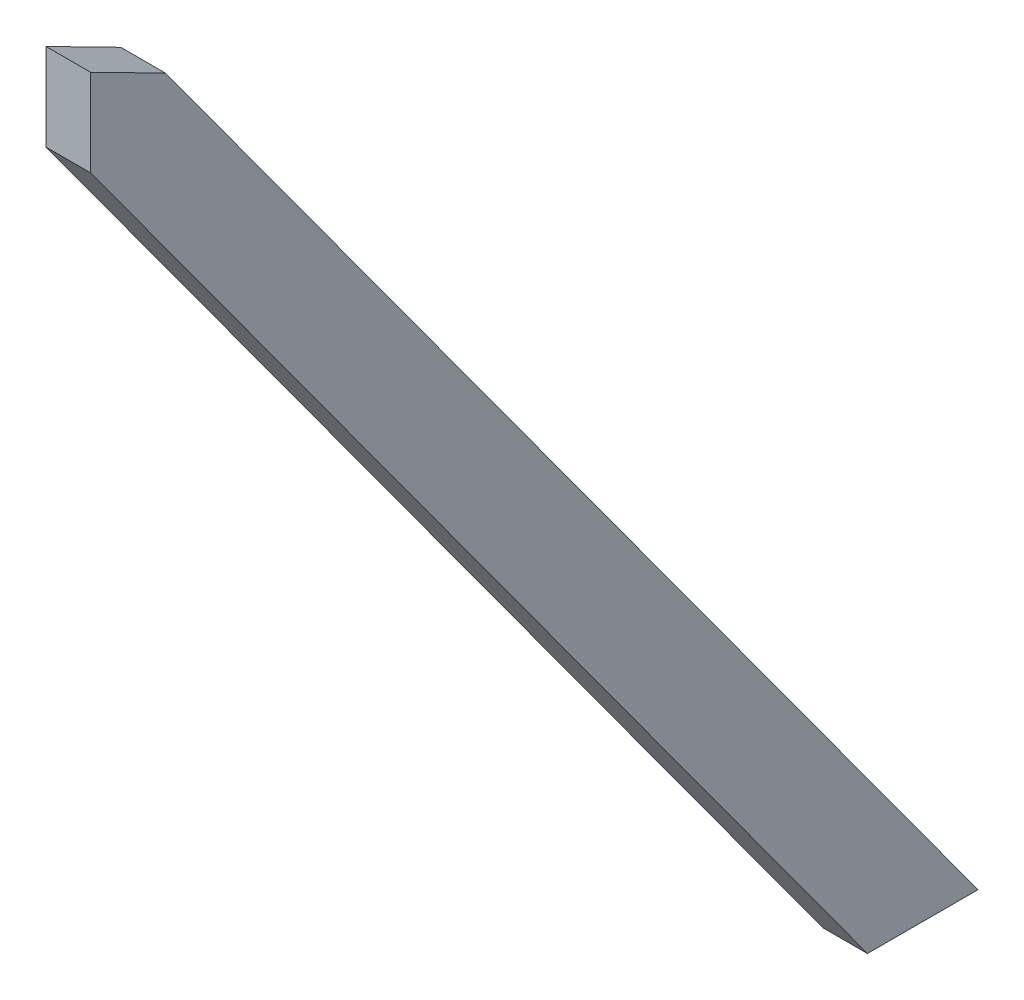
from build123d import *

# Parameters (mm, degrees)
EXTRUSION1_DEPTH = 5


with BuildPart() as part:
    # Esquisse1 → Extrusion1 (new body)
    with BuildSketch(Plane(origin=(0, 0, 0), x_dir=(0, 0, -1), z_dir=(1, 0, 0))):
        Polygon((-49.832981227, 50.819263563), (-49.832981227, 60.575338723), (-41.459402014, 56.30878701), (49.520688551, -68.364621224), (37.141144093, -68.364621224), align=None)
    extrude(amount=EXTRUSION1_DEPTH)


solid = part.part
